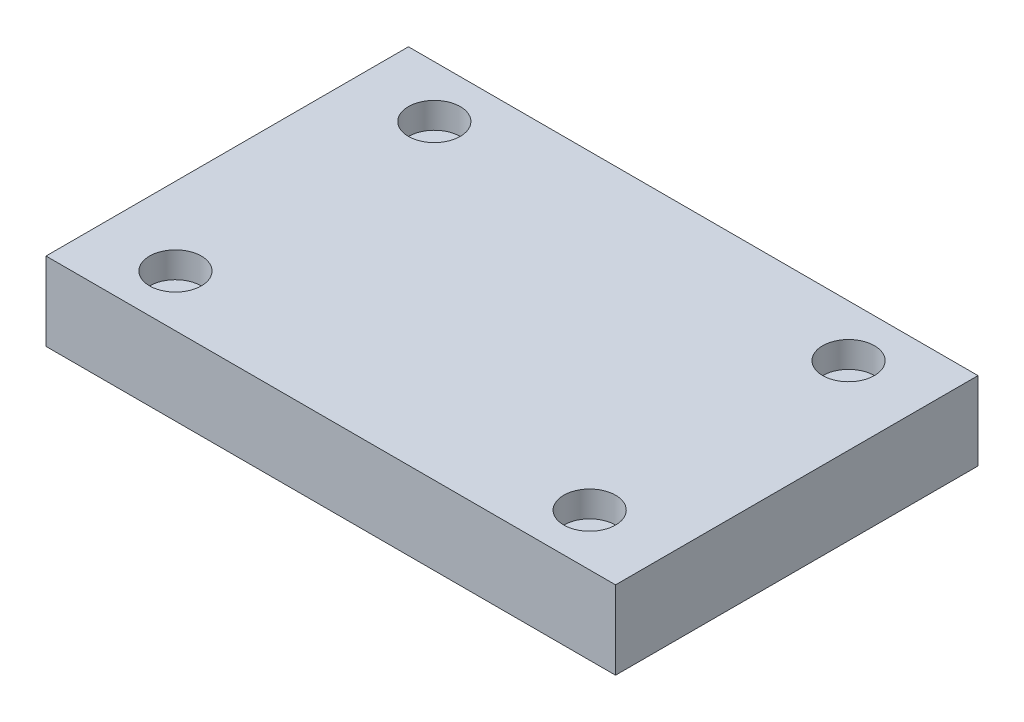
from build123d import *

# Parameters (mm, degrees)
SKETCH1_W          = 139.7
SKETCH1_H          = 88.9
EXTRUDE1_DEPTH     = 19.203523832
SKETCH2_R          = 6.35
CUT_EXTRUDE1_DEPTH = 6.35


with BuildPart() as part:
    # Sketch1 → Extrude1 (new body)
    with BuildSketch(Plane(origin=(0, 0, 0), x_dir=(1, 0, 0), z_dir=(0, 1, 0))):
        Rectangle(SKETCH1_W, SKETCH1_H)
    extrude(amount=EXTRUDE1_DEPTH)

    # Sketch2 → Cut-Extrude1 (cut)
    with BuildSketch(Plane(origin=(0, 19.203523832, 0), x_dir=(-1, 0, 0), z_dir=(0, 1, 0))):
        with Locations(Location((-50.8, 31.75, 0), (0, 0, 90))):
            Circle(SKETCH2_R)
        with Locations(Location((-50.8, -31.75, 0), (0, 0, 90))):
            Circle(SKETCH2_R)
        with Locations(Location((50.8, 31.75, 0), (0, 0, 90))):
            Circle(SKETCH2_R)
        with Locations(Location((50.8, -31.75, 0), (0, 0, 90))):
            Circle(SKETCH2_R)
    extrude(amount=-CUT_EXTRUDE1_DEPTH, mode=Mode.SUBTRACT)


solid = part.part
